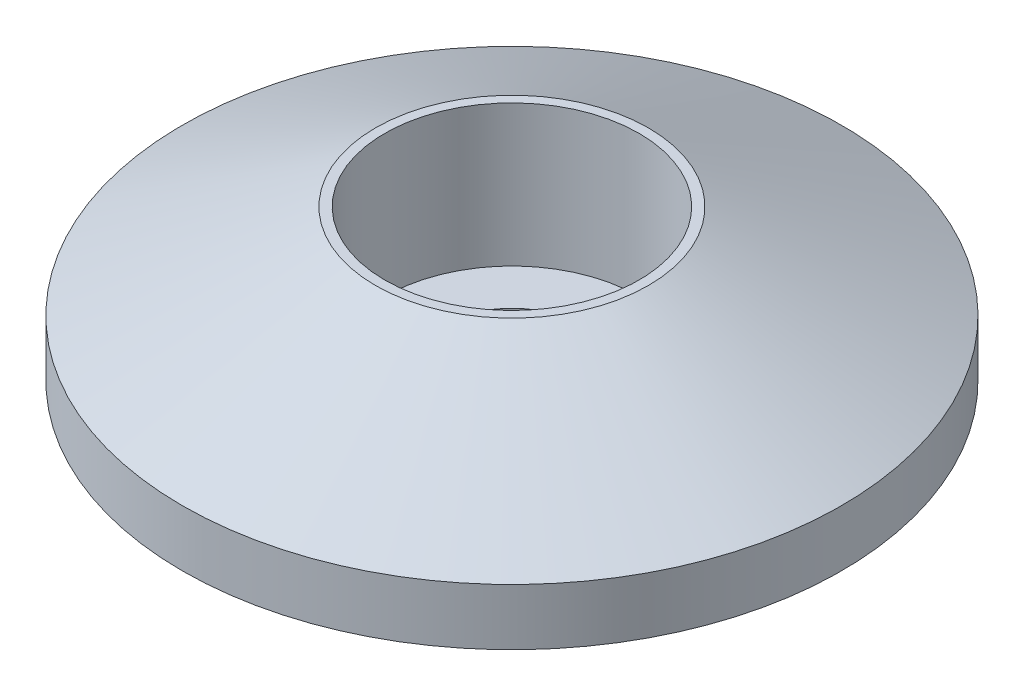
ISO-10303-21;
HEADER;
FILE_DESCRIPTION(('STEP AP214'),'2;1');
FILE_NAME('part.step','',(''),(''),'','','');
FILE_SCHEMA(('AUTOMOTIVE_DESIGN { 1 0 10303 214 1 1 1 1 }'));
ENDSEC;
DATA;
#1=APPLICATION_CONTEXT('core data for automotive mechanical design processes');
#2=APPLICATION_PROTOCOL_DEFINITION('international standard','automotive_design',2000,#1);
#3=PRODUCT_CONTEXT('',#1,'mechanical');
#4=PRODUCT('Part','Part','',(#3));
#5=PRODUCT_RELATED_PRODUCT_CATEGORY('part','',(#4));
#6=PRODUCT_DEFINITION_FORMATION('','',#4);
#7=PRODUCT_DEFINITION_CONTEXT('part definition',#1,'design');
#8=PRODUCT_DEFINITION('design','',#6,#7);
#9=PRODUCT_DEFINITION_SHAPE('','',#8);
#10=(LENGTH_UNIT() NAMED_UNIT(*) SI_UNIT(.MILLI.,.METRE.));
#11=(NAMED_UNIT(*) PLANE_ANGLE_UNIT() SI_UNIT($,.RADIAN.));
#12=(NAMED_UNIT(*) SI_UNIT($,.STERADIAN.) SOLID_ANGLE_UNIT());
#13=UNCERTAINTY_MEASURE_WITH_UNIT(LENGTH_MEASURE(1.E-05),#10,'distance_accuracy_value','');
#14=(GEOMETRIC_REPRESENTATION_CONTEXT(3) GLOBAL_UNCERTAINTY_ASSIGNED_CONTEXT((#13)) GLOBAL_UNIT_ASSIGNED_CONTEXT((#10,
#11,#12)) REPRESENTATION_CONTEXT('',''));
#15=CARTESIAN_POINT('',(0.,0.,0.));
#16=DIRECTION('',(0.,0.,1.));
#17=DIRECTION('',(1.,0.,0.));
#18=AXIS2_PLACEMENT_3D('',#15,#16,#17);
#19=CARTESIAN_POINT('',(0.,3.2,0.));
#20=DIRECTION('',(0.,-1.,0.));
#21=DIRECTION('',(0.,0.,-1.));
#22=AXIS2_PLACEMENT_3D('',#19,#20,#21);
#23=CYLINDRICAL_SURFACE('',#22,1.6);
#24=CARTESIAN_POINT('',(0.,0.,0.));
#25=DIRECTION('',(0.,1.,0.));
#26=DIRECTION('',(0.,0.,1.));
#27=AXIS2_PLACEMENT_3D('',#24,#25,#26);
#28=CIRCLE('',#27,1.6);
#29=CARTESIAN_POINT('',(0.,0.,1.6));
#30=VERTEX_POINT('',#29);
#31=EDGE_CURVE('E50',#30,#30,#28,.T.);
#32=ORIENTED_EDGE('',*,*,#31,.F.);
#33=EDGE_LOOP('',(#32));
#34=FACE_BOUND('',#33,.T.);
#35=CARTESIAN_POINT('',(0.,0.2,0.));
#36=DIRECTION('',(0.,1.,0.));
#37=DIRECTION('',(0.,0.,1.));
#38=AXIS2_PLACEMENT_3D('',#35,#36,#37);
#39=CIRCLE('',#38,1.6);
#40=CARTESIAN_POINT('',(0.,0.2,1.6));
#41=VERTEX_POINT('',#40);
#42=EDGE_CURVE('E53',#41,#41,#39,.T.);
#43=ORIENTED_EDGE('',*,*,#42,.T.);
#44=EDGE_LOOP('',(#43));
#45=FACE_BOUND('',#44,.T.);
#46=ADVANCED_FACE('F35',(#34,#45),#23,.F.);
#47=CARTESIAN_POINT('',(0.,3.2,0.));
#48=DIRECTION('',(0.,1.,0.));
#49=DIRECTION('',(0.,0.,1.));
#50=AXIS2_PLACEMENT_3D('',#47,#48,#49);
#51=PLANE('',#50);
#52=CARTESIAN_POINT('',(0.,3.2,0.));
#53=DIRECTION('',(0.,1.,0.));
#54=DIRECTION('',(0.,0.,1.));
#55=AXIS2_PLACEMENT_3D('',#52,#53,#54);
#56=CIRCLE('',#55,2.89939231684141);
#57=CARTESIAN_POINT('',(0.,3.2,2.89939231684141));
#58=VERTEX_POINT('',#57);
#59=EDGE_CURVE('E42',#58,#58,#56,.T.);
#60=ORIENTED_EDGE('',*,*,#59,.T.);
#61=EDGE_LOOP('',(#60));
#62=FACE_BOUND('',#61,.T.);
#63=CARTESIAN_POINT('',(0.,3.2,0.));
#64=DIRECTION('',(0.,1.,0.));
#65=DIRECTION('',(0.,0.,1.));
#66=AXIS2_PLACEMENT_3D('',#63,#64,#65);
#67=CIRCLE('',#66,2.7);
#68=CARTESIAN_POINT('',(0.,3.2,2.7));
#69=VERTEX_POINT('',#68);
#70=EDGE_CURVE('E61',#69,#69,#67,.T.);
#71=ORIENTED_EDGE('',*,*,#70,.F.);
#72=EDGE_LOOP('',(#71));
#73=FACE_BOUND('',#72,.T.);
#74=ADVANCED_FACE('F67',(#62,#73),#51,.T.);
#75=CARTESIAN_POINT('',(0.,0.,0.));
#76=DIRECTION('',(0.,1.,0.));
#77=DIRECTION('',(0.,0.,1.));
#78=AXIS2_PLACEMENT_3D('',#75,#76,#77);
#79=PLANE('',#78);
#80=CARTESIAN_POINT('',(0.,0.,0.));
#81=DIRECTION('',(0.,1.,0.));
#82=DIRECTION('',(0.,0.,1.));
#83=AXIS2_PLACEMENT_3D('',#80,#81,#82);
#84=CIRCLE('',#83,7.);
#85=CARTESIAN_POINT('',(0.,0.,7.));
#86=VERTEX_POINT('',#85);
#87=EDGE_CURVE('E46',#86,#86,#84,.T.);
#88=ORIENTED_EDGE('',*,*,#87,.F.);
#89=EDGE_LOOP('',(#88));
#90=FACE_BOUND('',#89,.T.);
#91=ORIENTED_EDGE('',*,*,#31,.T.);
#92=EDGE_LOOP('',(#91));
#93=FACE_BOUND('',#92,.T.);
#94=ADVANCED_FACE('F69',(#90,#93),#79,.F.);
#95=CARTESIAN_POINT('',(0.,3.2,0.));
#96=DIRECTION('',(0.,-1.,0.));
#97=DIRECTION('',(0.,0.,-1.));
#98=AXIS2_PLACEMENT_3D('',#95,#96,#97);
#99=CYLINDRICAL_SURFACE('',#98,7.);
#100=CARTESIAN_POINT('',(0.,1.2,0.));
#101=DIRECTION('',(0.,1.,0.));
#102=DIRECTION('',(0.,0.,1.));
#103=AXIS2_PLACEMENT_3D('',#100,#101,#102);
#104=CIRCLE('',#103,7.);
#105=CARTESIAN_POINT('',(0.,1.2,7.));
#106=VERTEX_POINT('',#105);
#107=EDGE_CURVE('E10',#106,#106,#104,.F.);
#108=ORIENTED_EDGE('',*,*,#107,.T.);
#109=EDGE_LOOP('',(#108));
#110=FACE_BOUND('',#109,.T.);
#111=ORIENTED_EDGE('',*,*,#87,.T.);
#112=EDGE_LOOP('',(#111));
#113=FACE_BOUND('',#112,.T.);
#114=ADVANCED_FACE('F37',(#110,#113),#99,.T.);
#115=CARTESIAN_POINT('',(0.,0.2,0.));
#116=DIRECTION('',(0.,1.,0.));
#117=DIRECTION('',(0.,0.,1.));
#118=AXIS2_PLACEMENT_3D('',#115,#116,#117);
#119=CYLINDRICAL_SURFACE('',#118,2.7);
#120=CARTESIAN_POINT('',(0.,0.2,0.));
#121=DIRECTION('',(0.,1.,0.));
#122=DIRECTION('',(0.,0.,1.));
#123=AXIS2_PLACEMENT_3D('',#120,#121,#122);
#124=CIRCLE('',#123,2.7);
#125=CARTESIAN_POINT('',(0.,0.2,2.7));
#126=VERTEX_POINT('',#125);
#127=EDGE_CURVE('E55',#126,#126,#124,.T.);
#128=ORIENTED_EDGE('',*,*,#127,.F.);
#129=EDGE_LOOP('',(#128));
#130=FACE_BOUND('',#129,.T.);
#131=ORIENTED_EDGE('',*,*,#70,.T.);
#132=EDGE_LOOP('',(#131));
#133=FACE_BOUND('',#132,.T.);
#134=ADVANCED_FACE('F65',(#130,#133),#119,.F.);
#135=CARTESIAN_POINT('',(0.,0.2,0.));
#136=DIRECTION('',(0.,1.,0.));
#137=DIRECTION('',(0.,0.,1.));
#138=AXIS2_PLACEMENT_3D('',#135,#136,#137);
#139=PLANE('',#138);
#140=ORIENTED_EDGE('',*,*,#42,.F.);
#141=EDGE_LOOP('',(#140));
#142=FACE_BOUND('',#141,.T.);
#143=ORIENTED_EDGE('',*,*,#127,.T.);
#144=EDGE_LOOP('',(#143));
#145=FACE_BOUND('',#144,.T.);
#146=ADVANCED_FACE('F81',(#142,#145),#139,.T.);
#147=CARTESIAN_POINT('',(0.,3.2,0.));
#148=DIRECTION('',(0.,-1.,0.));
#149=DIRECTION('',(0.,0.,-1.));
#150=AXIS2_PLACEMENT_3D('',#147,#148,#149);
#151=CONICAL_SURFACE('',#150,2.89939231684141,1.11701072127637);
#152=ORIENTED_EDGE('',*,*,#107,.F.);
#153=EDGE_LOOP('',(#152));
#154=FACE_BOUND('',#153,.T.);
#155=ORIENTED_EDGE('',*,*,#59,.F.);
#156=EDGE_LOOP('',(#155));
#157=FACE_BOUND('',#156,.T.);
#158=ADVANCED_FACE('F85',(#154,#157),#151,.T.);
#159=CLOSED_SHELL('',(#46,#74,#94,#114,#134,#146,#158));
#160=MANIFOLD_SOLID_BREP('B2',#159);
#161=ADVANCED_BREP_SHAPE_REPRESENTATION('',(#18,#160),#14);
#162=SHAPE_DEFINITION_REPRESENTATION(#9,#161);
ENDSEC;
END-ISO-10303-21;
